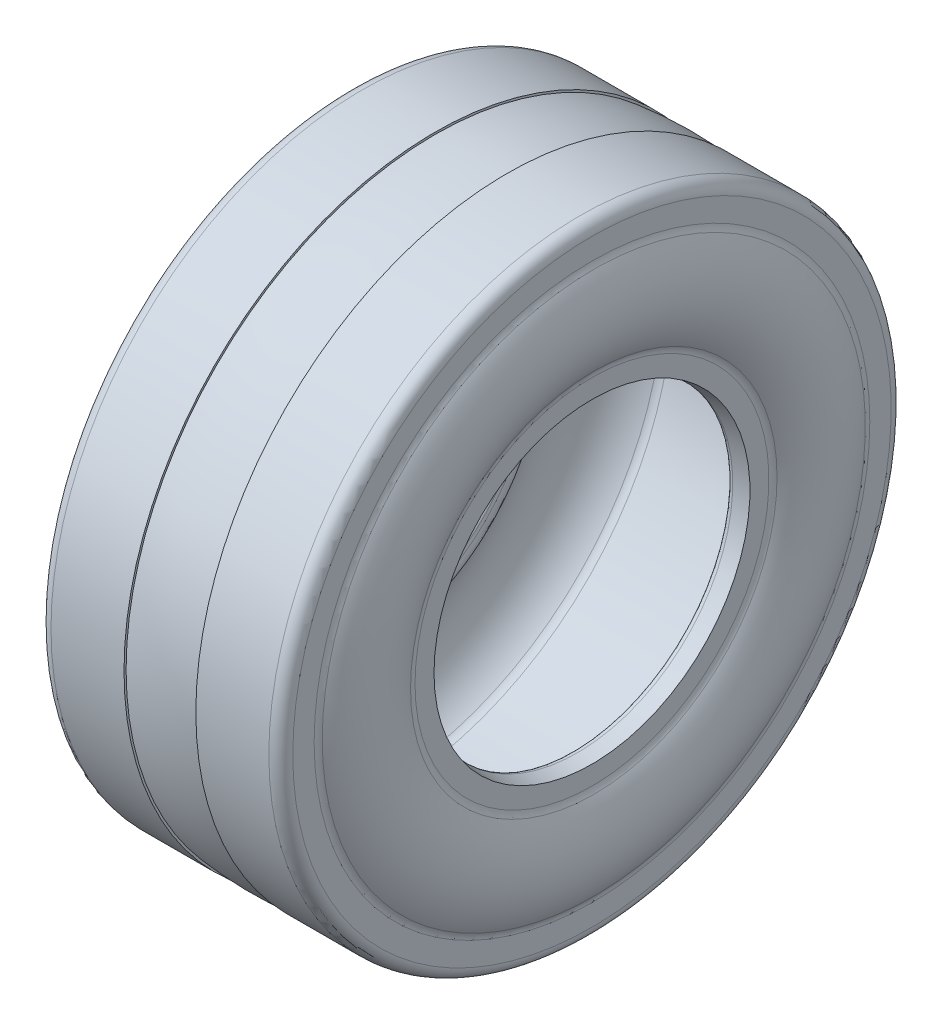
ISO-10303-21;
HEADER;
FILE_DESCRIPTION(('STEP AP214'),'2;1');
FILE_NAME('part.step','',(''),(''),'','','');
FILE_SCHEMA(('AUTOMOTIVE_DESIGN { 1 0 10303 214 1 1 1 1 }'));
ENDSEC;
DATA;
#1=APPLICATION_CONTEXT('core data for automotive mechanical design processes');
#2=APPLICATION_PROTOCOL_DEFINITION('international standard','automotive_design',2000,#1);
#3=PRODUCT_CONTEXT('',#1,'mechanical');
#4=PRODUCT('Part','Part','',(#3));
#5=PRODUCT_RELATED_PRODUCT_CATEGORY('part','',(#4));
#6=PRODUCT_DEFINITION_FORMATION('','',#4);
#7=PRODUCT_DEFINITION_CONTEXT('part definition',#1,'design');
#8=PRODUCT_DEFINITION('design','',#6,#7);
#9=PRODUCT_DEFINITION_SHAPE('','',#8);
#10=(LENGTH_UNIT() NAMED_UNIT(*) SI_UNIT(.MILLI.,.METRE.));
#11=(NAMED_UNIT(*) PLANE_ANGLE_UNIT() SI_UNIT($,.RADIAN.));
#12=(NAMED_UNIT(*) SI_UNIT($,.STERADIAN.) SOLID_ANGLE_UNIT());
#13=UNCERTAINTY_MEASURE_WITH_UNIT(LENGTH_MEASURE(1.E-05),#10,'distance_accuracy_value','');
#14=(GEOMETRIC_REPRESENTATION_CONTEXT(3) GLOBAL_UNCERTAINTY_ASSIGNED_CONTEXT((#13)) GLOBAL_UNIT_ASSIGNED_CONTEXT((#10,
#11,#12)) REPRESENTATION_CONTEXT('',''));
#15=CARTESIAN_POINT('',(0.,0.,0.));
#16=DIRECTION('',(0.,0.,1.));
#17=DIRECTION('',(1.,0.,0.));
#18=AXIS2_PLACEMENT_3D('',#15,#16,#17);
#19=CARTESIAN_POINT('',(2.35414438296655,-160.,0.));
#20=DIRECTION('',(-1.,0.,0.));
#21=DIRECTION('',(0.,0.,1.));
#22=AXIS2_PLACEMENT_3D('',#19,#20,#21);
#23=TOROIDAL_SURFACE('',#22,73.9286924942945,4.99999999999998);
#24=CARTESIAN_POINT('',(6.60414438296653,-160.,0.));
#25=DIRECTION('',(-1.,0.,0.));
#26=DIRECTION('',(0.,0.,1.));
#27=AXIS2_PLACEMENT_3D('',#24,#25,#26);
#28=CIRCLE('',#27,76.5626059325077);
#29=CARTESIAN_POINT('',(6.60414438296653,-160.,76.5626059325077));
#30=VERTEX_POINT('',#29);
#31=EDGE_CURVE('E130',#30,#30,#28,.T.);
#32=ORIENTED_EDGE('',*,*,#31,.T.);
#33=EDGE_LOOP('',(#32));
#34=FACE_BOUND('',#33,.T.);
#35=CARTESIAN_POINT('',(7.35414438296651,-160.,0.));
#36=DIRECTION('',(-1.,0.,0.));
#37=DIRECTION('',(0.,0.,1.));
#38=AXIS2_PLACEMENT_3D('',#35,#36,#37);
#39=CIRCLE('',#38,73.9286924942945);
#40=CARTESIAN_POINT('',(7.35414438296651,-160.,73.9286924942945));
#41=VERTEX_POINT('',#40);
#42=EDGE_CURVE('E10',#41,#41,#39,.T.);
#43=ORIENTED_EDGE('',*,*,#42,.F.);
#44=EDGE_LOOP('',(#43));
#45=FACE_BOUND('',#44,.T.);
#46=ADVANCED_FACE('F36',(#34,#45),#23,.F.);
#47=CARTESIAN_POINT('',(7.35414438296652,-86.0713075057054,0.));
#48=DIRECTION('',(1.,0.,0.));
#49=DIRECTION('',(0.,0.,-1.));
#50=AXIS2_PLACEMENT_3D('',#47,#48,#49);
#51=PLANE('',#50);
#52=CARTESIAN_POINT('',(7.35414438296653,-160.,0.));
#53=DIRECTION('',(-1.,0.,0.));
#54=DIRECTION('',(0.,0.,1.));
#55=AXIS2_PLACEMENT_3D('',#52,#53,#54);
#56=CIRCLE('',#55,66.);
#57=CARTESIAN_POINT('',(7.35414438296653,-160.,66.));
#58=VERTEX_POINT('',#57);
#59=EDGE_CURVE('E42',#58,#58,#56,.T.);
#60=ORIENTED_EDGE('',*,*,#59,.F.);
#61=EDGE_LOOP('',(#60));
#62=FACE_BOUND('',#61,.T.);
#63=ORIENTED_EDGE('',*,*,#42,.T.);
#64=EDGE_LOOP('',(#63));
#65=FACE_BOUND('',#64,.T.);
#66=ADVANCED_FACE('F154',(#62,#65),#51,.F.);
#67=CARTESIAN_POINT('',(7.35414438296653,-160.,0.));
#68=DIRECTION('',(-1.,0.,0.));
#69=DIRECTION('',(0.,0.,1.));
#70=AXIS2_PLACEMENT_3D('',#67,#68,#69);
#71=CONICAL_SURFACE('',#70,66.,0.157515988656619);
#72=CARTESIAN_POINT('',(13.5502001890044,-160.,0.));
#73=DIRECTION('',(-1.,0.,0.));
#74=DIRECTION('',(0.,0.,1.));
#75=AXIS2_PLACEMENT_3D('',#72,#73,#74);
#76=CIRCLE('',#75,65.015869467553);
#77=CARTESIAN_POINT('',(13.5502001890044,-160.,65.015869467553));
#78=VERTEX_POINT('',#77);
#79=EDGE_CURVE('E46',#78,#78,#76,.T.);
#80=ORIENTED_EDGE('',*,*,#79,.F.);
#81=EDGE_LOOP('',(#80));
#82=FACE_BOUND('',#81,.T.);
#83=ORIENTED_EDGE('',*,*,#59,.T.);
#84=EDGE_LOOP('',(#83));
#85=FACE_BOUND('',#84,.T.);
#86=ADVANCED_FACE('F158',(#82,#85),#71,.F.);
#87=CARTESIAN_POINT('',(13.8639310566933,-160.,0.));
#88=DIRECTION('',(-1.,0.,0.));
#89=DIRECTION('',(0.,0.,1.));
#90=AXIS2_PLACEMENT_3D('',#87,#88,#89);
#91=TOROIDAL_SURFACE('',#90,66.9911094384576,2.00000000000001);
#92=ORIENTED_EDGE('',*,*,#79,.T.);
#93=EDGE_LOOP('',(#92));
#94=FACE_BOUND('',#93,.T.);
#95=CARTESIAN_POINT('',(15.7721236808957,-160.,0.));
#96=DIRECTION('',(-1.,0.,0.));
#97=DIRECTION('',(0.,0.,1.));
#98=AXIS2_PLACEMENT_3D('',#95,#96,#97);
#99=CIRCLE('',#98,66.3921095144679);
#100=CARTESIAN_POINT('',(15.7721236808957,-160.,66.3921095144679));
#101=VERTEX_POINT('',#100);
#102=EDGE_CURVE('E50',#101,#101,#99,.T.);
#103=ORIENTED_EDGE('',*,*,#102,.F.);
#104=EDGE_LOOP('',(#103));
#105=FACE_BOUND('',#104,.T.);
#106=ADVANCED_FACE('F163',(#94,#105),#91,.T.);
#107=CARTESIAN_POINT('',(15.7721236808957,-160.,0.));
#108=DIRECTION('',(1.,0.,0.));
#109=DIRECTION('',(0.,0.,-1.));
#110=AXIS2_PLACEMENT_3D('',#107,#108,#109);
#111=CONICAL_SURFACE('',#110,66.3921095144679,1.26662781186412);
#112=CARTESIAN_POINT('',(16.1448141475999,-160.,0.));
#113=DIRECTION('',(-1.,0.,0.));
#114=DIRECTION('',(0.,0.,1.));
#115=AXIS2_PLACEMENT_3D('',#112,#113,#114);
#116=CIRCLE('',#115,67.5793637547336);
#117=CARTESIAN_POINT('',(16.1448141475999,-160.,67.5793637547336));
#118=VERTEX_POINT('',#117);
#119=EDGE_CURVE('E55',#118,#118,#116,.T.);
#120=ORIENTED_EDGE('',*,*,#119,.F.);
#121=EDGE_LOOP('',(#120));
#122=FACE_BOUND('',#121,.T.);
#123=ORIENTED_EDGE('',*,*,#102,.T.);
#124=EDGE_LOOP('',(#123));
#125=FACE_BOUND('',#124,.T.);
#126=ADVANCED_FACE('F169',(#122,#125),#111,.F.);
#127=CARTESIAN_POINT('',(11.3743325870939,-160.,0.));
#128=DIRECTION('',(-1.,0.,0.));
#129=DIRECTION('',(0.,0.,1.));
#130=AXIS2_PLACEMENT_3D('',#127,#128,#129);
#131=TOROIDAL_SURFACE('',#130,69.0768635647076,5.);
#132=ORIENTED_EDGE('',*,*,#119,.T.);
#133=EDGE_LOOP('',(#132));
#134=FACE_BOUND('',#133,.T.);
#135=CARTESIAN_POINT('',(14.8437508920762,-160.,0.));
#136=DIRECTION('',(-1.,0.,0.));
#137=DIRECTION('',(0.,0.,1.));
#138=AXIS2_PLACEMENT_3D('',#135,#136,#137);
#139=CIRCLE('',#138,72.6772991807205);
#140=CARTESIAN_POINT('',(14.8437508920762,-160.,72.6772991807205));
#141=VERTEX_POINT('',#140);
#142=EDGE_CURVE('E58',#141,#141,#139,.T.);
#143=ORIENTED_EDGE('',*,*,#142,.F.);
#144=EDGE_LOOP('',(#143));
#145=FACE_BOUND('',#144,.T.);
#146=ADVANCED_FACE('F173',(#134,#145),#131,.T.);
#147=CARTESIAN_POINT('',(36.3541443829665,-160.,0.));
#148=DIRECTION('',(-1.,0.,0.));
#149=DIRECTION('',(0.,0.,1.));
#150=AXIS2_PLACEMENT_3D('',#147,#148,#149);
#151=TOROIDAL_SURFACE('',#150,95.,31.);
#152=ORIENTED_EDGE('',*,*,#142,.T.);
#153=EDGE_LOOP('',(#152));
#154=FACE_BOUND('',#153,.T.);
#155=CARTESIAN_POINT('',(18.0764135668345,-160.,0.));
#156=DIRECTION('',(-1.,0.,0.));
#157=DIRECTION('',(0.,0.,1.));
#158=AXIS2_PLACEMENT_3D('',#155,#156,#157);
#159=CIRCLE('',#158,120.038461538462);
#160=CARTESIAN_POINT('',(18.0764135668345,-160.,120.038461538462));
#161=VERTEX_POINT('',#160);
#162=EDGE_CURVE('E61',#161,#161,#159,.T.);
#163=ORIENTED_EDGE('',*,*,#162,.F.);
#164=EDGE_LOOP('',(#163));
#165=FACE_BOUND('',#164,.T.);
#166=ADVANCED_FACE('F177',(#154,#165),#151,.F.);
#167=CARTESIAN_POINT('',(21.0244346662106,-160.,0.));
#168=DIRECTION('',(-1.,0.,0.));
#169=DIRECTION('',(0.,0.,1.));
#170=AXIS2_PLACEMENT_3D('',#167,#168,#169);
#171=TOROIDAL_SURFACE('',#170,116.,5.);
#172=ORIENTED_EDGE('',*,*,#162,.T.);
#173=EDGE_LOOP('',(#172));
#174=FACE_BOUND('',#173,.T.);
#175=CARTESIAN_POINT('',(21.0244346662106,-160.,0.));
#176=DIRECTION('',(-1.,0.,0.));
#177=DIRECTION('',(0.,0.,1.));
#178=AXIS2_PLACEMENT_3D('',#175,#176,#177);
#179=CIRCLE('',#178,121.);
#180=CARTESIAN_POINT('',(21.0244346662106,-160.,121.));
#181=VERTEX_POINT('',#180);
#182=EDGE_CURVE('E64',#181,#181,#179,.T.);
#183=ORIENTED_EDGE('',*,*,#182,.F.);
#184=EDGE_LOOP('',(#183));
#185=FACE_BOUND('',#184,.T.);
#186=ADVANCED_FACE('F181',(#174,#185),#171,.F.);
#187=CARTESIAN_POINT('',(0.,-160.,0.));
#188=DIRECTION('',(-1.,0.,0.));
#189=DIRECTION('',(0.,0.,1.));
#190=AXIS2_PLACEMENT_3D('',#187,#188,#189);
#191=CYLINDRICAL_SURFACE('',#190,121.);
#192=CARTESIAN_POINT('',(94.6838540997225,-160.,0.));
#193=DIRECTION('',(-1.,0.,0.));
#194=DIRECTION('',(0.,0.,1.));
#195=AXIS2_PLACEMENT_3D('',#192,#193,#194);
#196=CIRCLE('',#195,121.);
#197=CARTESIAN_POINT('',(94.6838540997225,-160.,121.));
#198=VERTEX_POINT('',#197);
#199=EDGE_CURVE('E67',#198,#198,#196,.T.);
#200=ORIENTED_EDGE('',*,*,#199,.F.);
#201=EDGE_LOOP('',(#200));
#202=FACE_BOUND('',#201,.T.);
#203=ORIENTED_EDGE('',*,*,#182,.T.);
#204=EDGE_LOOP('',(#203));
#205=FACE_BOUND('',#204,.T.);
#206=ADVANCED_FACE('F185',(#202,#205),#191,.F.);
#207=CARTESIAN_POINT('',(94.6838540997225,-160.,0.));
#208=DIRECTION('',(-1.,0.,0.));
#209=DIRECTION('',(0.,0.,1.));
#210=AXIS2_PLACEMENT_3D('',#207,#208,#209);
#211=TOROIDAL_SURFACE('',#210,116.,5.);
#212=CARTESIAN_POINT('',(97.6318751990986,-160.,0.));
#213=DIRECTION('',(-1.,0.,0.));
#214=DIRECTION('',(0.,0.,1.));
#215=AXIS2_PLACEMENT_3D('',#212,#213,#214);
#216=CIRCLE('',#215,120.038461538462);
#217=CARTESIAN_POINT('',(97.6318751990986,-160.,120.038461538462));
#218=VERTEX_POINT('',#217);
#219=EDGE_CURVE('E70',#218,#218,#216,.T.);
#220=ORIENTED_EDGE('',*,*,#219,.F.);
#221=EDGE_LOOP('',(#220));
#222=FACE_BOUND('',#221,.T.);
#223=ORIENTED_EDGE('',*,*,#199,.T.);
#224=EDGE_LOOP('',(#223));
#225=FACE_BOUND('',#224,.T.);
#226=ADVANCED_FACE('F189',(#222,#225),#211,.F.);
#227=CARTESIAN_POINT('',(79.3541443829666,-160.,0.));
#228=DIRECTION('',(-1.,0.,0.));
#229=DIRECTION('',(0.,0.,1.));
#230=AXIS2_PLACEMENT_3D('',#227,#228,#229);
#231=TOROIDAL_SURFACE('',#230,95.,31.);
#232=CARTESIAN_POINT('',(100.864537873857,-160.,0.));
#233=DIRECTION('',(-1.,0.,0.));
#234=DIRECTION('',(0.,0.,1.));
#235=AXIS2_PLACEMENT_3D('',#232,#233,#234);
#236=CIRCLE('',#235,72.6772991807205);
#237=CARTESIAN_POINT('',(100.864537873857,-160.,72.6772991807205));
#238=VERTEX_POINT('',#237);
#239=EDGE_CURVE('E73',#238,#238,#236,.T.);
#240=ORIENTED_EDGE('',*,*,#239,.F.);
#241=EDGE_LOOP('',(#240));
#242=FACE_BOUND('',#241,.T.);
#243=ORIENTED_EDGE('',*,*,#219,.T.);
#244=EDGE_LOOP('',(#243));
#245=FACE_BOUND('',#244,.T.);
#246=ADVANCED_FACE('F193',(#242,#245),#231,.F.);
#247=CARTESIAN_POINT('',(104.333956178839,-160.,0.));
#248=DIRECTION('',(-1.,0.,0.));
#249=DIRECTION('',(0.,0.,1.));
#250=AXIS2_PLACEMENT_3D('',#247,#248,#249);
#251=TOROIDAL_SURFACE('',#250,69.0768635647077,5.);
#252=CARTESIAN_POINT('',(99.5634746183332,-160.,0.));
#253=DIRECTION('',(-1.,0.,0.));
#254=DIRECTION('',(0.,0.,1.));
#255=AXIS2_PLACEMENT_3D('',#252,#253,#254);
#256=CIRCLE('',#255,67.5793637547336);
#257=CARTESIAN_POINT('',(99.5634746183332,-160.,67.5793637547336));
#258=VERTEX_POINT('',#257);
#259=EDGE_CURVE('E76',#258,#258,#256,.T.);
#260=ORIENTED_EDGE('',*,*,#259,.F.);
#261=EDGE_LOOP('',(#260));
#262=FACE_BOUND('',#261,.T.);
#263=ORIENTED_EDGE('',*,*,#239,.T.);
#264=EDGE_LOOP('',(#263));
#265=FACE_BOUND('',#264,.T.);
#266=ADVANCED_FACE('F197',(#262,#265),#251,.T.);
#267=CARTESIAN_POINT('',(99.9361650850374,-160.,0.));
#268=DIRECTION('',(-1.,0.,0.));
#269=DIRECTION('',(0.,0.,1.));
#270=AXIS2_PLACEMENT_3D('',#267,#268,#269);
#271=CONICAL_SURFACE('',#270,66.3921095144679,1.26662781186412);
#272=ORIENTED_EDGE('',*,*,#259,.T.);
#273=EDGE_LOOP('',(#272));
#274=FACE_BOUND('',#273,.T.);
#275=CARTESIAN_POINT('',(99.9361650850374,-160.,0.));
#276=DIRECTION('',(-1.,0.,0.));
#277=DIRECTION('',(0.,0.,1.));
#278=AXIS2_PLACEMENT_3D('',#275,#276,#277);
#279=CIRCLE('',#278,66.3921095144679);
#280=CARTESIAN_POINT('',(99.9361650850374,-160.,66.3921095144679));
#281=VERTEX_POINT('',#280);
#282=EDGE_CURVE('E79',#281,#281,#279,.T.);
#283=ORIENTED_EDGE('',*,*,#282,.F.);
#284=EDGE_LOOP('',(#283));
#285=FACE_BOUND('',#284,.T.);
#286=ADVANCED_FACE('F201',(#274,#285),#271,.F.);
#287=CARTESIAN_POINT('',(101.84435770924,-160.,0.));
#288=DIRECTION('',(-1.,0.,0.));
#289=DIRECTION('',(0.,0.,1.));
#290=AXIS2_PLACEMENT_3D('',#287,#288,#289);
#291=TOROIDAL_SURFACE('',#290,66.9911094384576,2.);
#292=CARTESIAN_POINT('',(102.158088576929,-160.,0.));
#293=DIRECTION('',(-1.,0.,0.));
#294=DIRECTION('',(0.,0.,1.));
#295=AXIS2_PLACEMENT_3D('',#292,#293,#294);
#296=CIRCLE('',#295,65.015869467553);
#297=CARTESIAN_POINT('',(102.158088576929,-160.,65.015869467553));
#298=VERTEX_POINT('',#297);
#299=EDGE_CURVE('E82',#298,#298,#296,.T.);
#300=ORIENTED_EDGE('',*,*,#299,.F.);
#301=EDGE_LOOP('',(#300));
#302=FACE_BOUND('',#301,.T.);
#303=ORIENTED_EDGE('',*,*,#282,.T.);
#304=EDGE_LOOP('',(#303));
#305=FACE_BOUND('',#304,.T.);
#306=ADVANCED_FACE('F205',(#302,#305),#291,.T.);
#307=CARTESIAN_POINT('',(108.354144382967,-160.,0.));
#308=DIRECTION('',(1.,0.,0.));
#309=DIRECTION('',(0.,0.,-1.));
#310=AXIS2_PLACEMENT_3D('',#307,#308,#309);
#311=CONICAL_SURFACE('',#310,66.,0.157515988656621);
#312=ORIENTED_EDGE('',*,*,#299,.T.);
#313=EDGE_LOOP('',(#312));
#314=FACE_BOUND('',#313,.T.);
#315=CARTESIAN_POINT('',(108.354144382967,-160.,0.));
#316=DIRECTION('',(-1.,0.,0.));
#317=DIRECTION('',(0.,0.,1.));
#318=AXIS2_PLACEMENT_3D('',#315,#316,#317);
#319=CIRCLE('',#318,66.);
#320=CARTESIAN_POINT('',(108.354144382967,-160.,66.));
#321=VERTEX_POINT('',#320);
#322=EDGE_CURVE('E85',#321,#321,#319,.T.);
#323=ORIENTED_EDGE('',*,*,#322,.F.);
#324=EDGE_LOOP('',(#323));
#325=FACE_BOUND('',#324,.T.);
#326=ADVANCED_FACE('F209',(#314,#325),#311,.F.);
#327=CARTESIAN_POINT('',(108.354144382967,-86.0713075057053,0.));
#328=DIRECTION('',(1.,0.,0.));
#329=DIRECTION('',(0.,0.,-1.));
#330=AXIS2_PLACEMENT_3D('',#327,#328,#329);
#331=PLANE('',#330);
#332=ORIENTED_EDGE('',*,*,#322,.T.);
#333=EDGE_LOOP('',(#332));
#334=FACE_BOUND('',#333,.T.);
#335=CARTESIAN_POINT('',(108.354144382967,-160.,0.));
#336=DIRECTION('',(-1.,0.,0.));
#337=DIRECTION('',(0.,0.,1.));
#338=AXIS2_PLACEMENT_3D('',#335,#336,#337);
#339=CIRCLE('',#338,73.9286924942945);
#340=CARTESIAN_POINT('',(108.354144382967,-160.,73.9286924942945));
#341=VERTEX_POINT('',#340);
#342=EDGE_CURVE('E88',#341,#341,#339,.T.);
#343=ORIENTED_EDGE('',*,*,#342,.F.);
#344=EDGE_LOOP('',(#343));
#345=FACE_BOUND('',#344,.T.);
#346=ADVANCED_FACE('F213',(#334,#345),#331,.T.);
#347=CARTESIAN_POINT('',(113.354144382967,-160.,0.));
#348=DIRECTION('',(-1.,0.,0.));
#349=DIRECTION('',(0.,0.,1.));
#350=AXIS2_PLACEMENT_3D('',#347,#348,#349);
#351=TOROIDAL_SURFACE('',#350,73.9286924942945,4.99999999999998);
#352=CARTESIAN_POINT('',(109.104144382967,-160.,0.));
#353=DIRECTION('',(-1.,0.,0.));
#354=DIRECTION('',(0.,0.,1.));
#355=AXIS2_PLACEMENT_3D('',#352,#353,#354);
#356=CIRCLE('',#355,76.5626059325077);
#357=CARTESIAN_POINT('',(109.104144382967,-160.,76.5626059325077));
#358=VERTEX_POINT('',#357);
#359=EDGE_CURVE('E91',#358,#358,#356,.T.);
#360=ORIENTED_EDGE('',*,*,#359,.F.);
#361=EDGE_LOOP('',(#360));
#362=FACE_BOUND('',#361,.T.);
#363=ORIENTED_EDGE('',*,*,#342,.T.);
#364=EDGE_LOOP('',(#363));
#365=FACE_BOUND('',#364,.T.);
#366=ADVANCED_FACE('F217',(#362,#365),#351,.F.);
#367=CARTESIAN_POINT('',(79.3541443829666,-160.,0.));
#368=DIRECTION('',(-1.,0.,0.));
#369=DIRECTION('',(0.,0.,1.));
#370=AXIS2_PLACEMENT_3D('',#367,#368,#369);
#371=TOROIDAL_SURFACE('',#370,95.,35.);
#372=ORIENTED_EDGE('',*,*,#359,.T.);
#373=EDGE_LOOP('',(#372));
#374=FACE_BOUND('',#373,.T.);
#375=CARTESIAN_POINT('',(109.104144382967,-160.,0.));
#376=DIRECTION('',(-1.,0.,0.));
#377=DIRECTION('',(0.,0.,1.));
#378=AXIS2_PLACEMENT_3D('',#375,#376,#377);
#379=CIRCLE('',#378,113.437394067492);
#380=CARTESIAN_POINT('',(109.104144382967,-160.,113.437394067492));
#381=VERTEX_POINT('',#380);
#382=EDGE_CURVE('E94',#381,#381,#379,.T.);
#383=ORIENTED_EDGE('',*,*,#382,.F.);
#384=EDGE_LOOP('',(#383));
#385=FACE_BOUND('',#384,.T.);
#386=ADVANCED_FACE('F221',(#374,#385),#371,.T.);
#387=CARTESIAN_POINT('',(113.354144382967,-160.,0.));
#388=DIRECTION('',(-1.,0.,0.));
#389=DIRECTION('',(0.,0.,1.));
#390=AXIS2_PLACEMENT_3D('',#387,#388,#389);
#391=TOROIDAL_SURFACE('',#390,116.071307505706,4.99999999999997);
#392=CARTESIAN_POINT('',(108.354144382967,-160.,0.));
#393=DIRECTION('',(-1.,0.,0.));
#394=DIRECTION('',(0.,0.,1.));
#395=AXIS2_PLACEMENT_3D('',#392,#393,#394);
#396=CIRCLE('',#395,116.071307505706);
#397=CARTESIAN_POINT('',(108.354144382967,-160.,116.071307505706));
#398=VERTEX_POINT('',#397);
#399=EDGE_CURVE('E97',#398,#398,#396,.T.);
#400=ORIENTED_EDGE('',*,*,#399,.F.);
#401=EDGE_LOOP('',(#400));
#402=FACE_BOUND('',#401,.T.);
#403=ORIENTED_EDGE('',*,*,#382,.T.);
#404=EDGE_LOOP('',(#403));
#405=FACE_BOUND('',#404,.T.);
#406=ADVANCED_FACE('F225',(#402,#405),#391,.F.);
#407=CARTESIAN_POINT('',(108.354144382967,-34.9999999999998,0.));
#408=DIRECTION('',(1.,0.,0.));
#409=DIRECTION('',(0.,0.,-1.));
#410=AXIS2_PLACEMENT_3D('',#407,#408,#409);
#411=PLANE('',#410);
#412=ORIENTED_EDGE('',*,*,#399,.T.);
#413=EDGE_LOOP('',(#412));
#414=FACE_BOUND('',#413,.T.);
#415=CARTESIAN_POINT('',(108.354144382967,-160.,0.));
#416=DIRECTION('',(-1.,0.,0.));
#417=DIRECTION('',(0.,0.,1.));
#418=AXIS2_PLACEMENT_3D('',#415,#416,#417);
#419=CIRCLE('',#418,125.);
#420=CARTESIAN_POINT('',(108.354144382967,-160.,125.));
#421=VERTEX_POINT('',#420);
#422=EDGE_CURVE('E100',#421,#421,#419,.T.);
#423=ORIENTED_EDGE('',*,*,#422,.F.);
#424=EDGE_LOOP('',(#423));
#425=FACE_BOUND('',#424,.T.);
#426=ADVANCED_FACE('F229',(#414,#425),#411,.T.);
#427=CARTESIAN_POINT('',(103.354144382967,-160.,0.));
#428=DIRECTION('',(-1.,0.,0.));
#429=DIRECTION('',(0.,0.,1.));
#430=AXIS2_PLACEMENT_3D('',#427,#428,#429);
#431=TOROIDAL_SURFACE('',#430,125.,5.);
#432=ORIENTED_EDGE('',*,*,#422,.T.);
#433=EDGE_LOOP('',(#432));
#434=FACE_BOUND('',#433,.T.);
#435=CARTESIAN_POINT('',(103.354144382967,-160.,0.));
#436=DIRECTION('',(-1.,0.,0.));
#437=DIRECTION('',(0.,0.,1.));
#438=AXIS2_PLACEMENT_3D('',#435,#436,#437);
#439=CIRCLE('',#438,130.);
#440=CARTESIAN_POINT('',(103.354144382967,-160.,130.));
#441=VERTEX_POINT('',#440);
#442=EDGE_CURVE('E103',#441,#441,#439,.T.);
#443=ORIENTED_EDGE('',*,*,#442,.F.);
#444=EDGE_LOOP('',(#443));
#445=FACE_BOUND('',#444,.T.);
#446=ADVANCED_FACE('F233',(#434,#445),#431,.T.);
#447=CARTESIAN_POINT('',(0.,-160.,0.));
#448=DIRECTION('',(-1.,0.,0.));
#449=DIRECTION('',(0.,0.,1.));
#450=AXIS2_PLACEMENT_3D('',#447,#448,#449);
#451=CYLINDRICAL_SURFACE('',#450,130.);
#452=ORIENTED_EDGE('',*,*,#442,.T.);
#453=EDGE_LOOP('',(#452));
#454=FACE_BOUND('',#453,.T.);
#455=CARTESIAN_POINT('',(72.8541443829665,-160.,0.));
#456=DIRECTION('',(-1.,0.,0.));
#457=DIRECTION('',(0.,0.,1.));
#458=AXIS2_PLACEMENT_3D('',#455,#456,#457);
#459=CIRCLE('',#458,130.);
#460=CARTESIAN_POINT('',(72.8541443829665,-160.,130.));
#461=VERTEX_POINT('',#460);
#462=EDGE_CURVE('E106',#461,#461,#459,.T.);
#463=ORIENTED_EDGE('',*,*,#462,.F.);
#464=EDGE_LOOP('',(#463));
#465=FACE_BOUND('',#464,.T.);
#466=ADVANCED_FACE('F237',(#454,#465),#451,.T.);
#467=CARTESIAN_POINT('',(72.8541443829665,-29.9999999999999,0.));
#468=DIRECTION('',(1.,0.,0.));
#469=DIRECTION('',(0.,0.,-1.));
#470=AXIS2_PLACEMENT_3D('',#467,#468,#469);
#471=PLANE('',#470);
#472=CARTESIAN_POINT('',(72.8541443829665,-160.,0.));
#473=DIRECTION('',(-1.,0.,0.));
#474=DIRECTION('',(0.,0.,1.));
#475=AXIS2_PLACEMENT_3D('',#472,#473,#474);
#476=CIRCLE('',#475,129.13171570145);
#477=CARTESIAN_POINT('',(72.8541443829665,-30.8682842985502,0.));
#478=VERTEX_POINT('',#477);
#479=EDGE_CURVE('E109',#478,#478,#476,.T.);
#480=ORIENTED_EDGE('',*,*,#479,.F.);
#481=EDGE_LOOP('',(#480));
#482=FACE_BOUND('',#481,.T.);
#483=ORIENTED_EDGE('',*,*,#462,.T.);
#484=EDGE_LOOP('',(#483));
#485=FACE_BOUND('',#484,.T.);
#486=ADVANCED_FACE('F241',(#482,#485),#471,.F.);
#487=CARTESIAN_POINT('',(57.8541443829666,-160.,0.));
#488=DIRECTION('',(-1.,0.,0.));
#489=DIRECTION('',(0.,1.,0.));
#490=AXIS2_PLACEMENT_3D('',#487,#488,#489);
#491=SPHERICAL_SURFACE('',#490,130.);
#492=CARTESIAN_POINT('',(42.8541443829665,-160.,0.));
#493=DIRECTION('',(-1.,0.,0.));
#494=DIRECTION('',(0.,0.,1.));
#495=AXIS2_PLACEMENT_3D('',#492,#493,#494);
#496=CIRCLE('',#495,129.13171570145);
#497=CARTESIAN_POINT('',(42.8541443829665,-30.8682842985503,0.));
#498=VERTEX_POINT('',#497);
#499=EDGE_CURVE('E112',#498,#498,#496,.T.);
#500=CARTESIAN_POINT('',(42.8541443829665,-30.8682842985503,0.));
#501=CARTESIAN_POINT('',(43.1652501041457,-30.8321460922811,0.));
#502=CARTESIAN_POINT('',(43.4764864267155,-30.7971322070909,0.));
#503=CARTESIAN_POINT('',(44.0992040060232,-30.7293548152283,0.));
#504=CARTESIAN_POINT('',(44.4106852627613,-30.6965913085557,0.));
#505=CARTESIAN_POINT('',(45.0338764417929,-30.6333164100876,0.));
#506=CARTESIAN_POINT('',(45.3455863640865,-30.602805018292,0.));
#507=CARTESIAN_POINT('',(45.969218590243,-30.5440359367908,0.));
#508=CARTESIAN_POINT('',(46.2811408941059,-30.5157782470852,0.));
#509=CARTESIAN_POINT('',(46.9051815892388,-30.4615180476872,0.));
#510=CARTESIAN_POINT('',(47.2172999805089,-30.4355155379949,0.));
#511=CARTESIAN_POINT('',(47.8417165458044,-30.3857670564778,0.));
#512=CARTESIAN_POINT('',(48.1540147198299,-30.362021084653,0.));
#513=CARTESIAN_POINT('',(48.7787745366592,-30.3167869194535,0.));
#514=CARTESIAN_POINT('',(49.091236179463,-30.2952987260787,0.));
#515=CARTESIAN_POINT('',(49.7163066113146,-30.2545812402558,0.));
#516=CARTESIAN_POINT('',(50.0289154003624,-30.2353519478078,0.));
#517=CARTESIAN_POINT('',(50.6542637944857,-30.1991532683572,0.));
#518=CARTESIAN_POINT('',(50.9670033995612,-30.1821838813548,0.));
#519=CARTESIAN_POINT('',(51.5925970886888,-30.1505058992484,0.));
#520=CARTESIAN_POINT('',(51.9054511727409,-30.1357973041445,0.));
#521=CARTESIAN_POINT('',(52.5312574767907,-30.108641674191,0.));
#522=CARTESIAN_POINT('',(52.8442096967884,-30.0961946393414,0.));
#523=CARTESIAN_POINT('',(53.4701959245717,-30.0735627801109,0.));
#524=CARTESIAN_POINT('',(53.7832299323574,-30.06337795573,0.));
#525=CARTESIAN_POINT('',(54.4093633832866,-30.045271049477,0.));
#526=CARTESIAN_POINT('',(54.7224628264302,-30.0373489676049,0.));
#527=CARTESIAN_POINT('',(55.3487107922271,-30.0237679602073,0.));
#528=CARTESIAN_POINT('',(55.6618593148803,-30.0181090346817,0.));
#529=CARTESIAN_POINT('',(56.2881890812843,-30.0090546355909,0.));
#530=CARTESIAN_POINT('',(56.6013703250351,-30.0056591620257,0.));
#531=CARTESIAN_POINT('',(57.2277491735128,-30.0011318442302,0.));
#532=CARTESIAN_POINT('',(57.5409467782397,-29.9999999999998,0.));
#533=CARTESIAN_POINT('',(58.1673419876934,-29.9999999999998,0.));
#534=CARTESIAN_POINT('',(58.4805395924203,-30.0011318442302,0.));
#535=CARTESIAN_POINT('',(59.106918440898,-30.0056591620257,0.));
#536=CARTESIAN_POINT('',(59.4200996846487,-30.0090546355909,0.));
#537=CARTESIAN_POINT('',(60.0464294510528,-30.0181090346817,0.));
#538=CARTESIAN_POINT('',(60.359577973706,-30.0237679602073,0.));
#539=CARTESIAN_POINT('',(60.9858259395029,-30.0373489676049,0.));
#540=CARTESIAN_POINT('',(61.2989253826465,-30.045271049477,0.));
#541=CARTESIAN_POINT('',(61.9250588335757,-30.06337795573,0.));
#542=CARTESIAN_POINT('',(62.2380928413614,-30.0735627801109,0.));
#543=CARTESIAN_POINT('',(62.8640790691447,-30.0961946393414,0.));
#544=CARTESIAN_POINT('',(63.1770312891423,-30.108641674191,0.));
#545=CARTESIAN_POINT('',(63.8028375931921,-30.1357973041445,0.));
#546=CARTESIAN_POINT('',(64.1156916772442,-30.1505058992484,0.));
#547=CARTESIAN_POINT('',(64.7412853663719,-30.1821838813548,0.));
#548=CARTESIAN_POINT('',(65.0540249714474,-30.1991532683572,0.));
#549=CARTESIAN_POINT('',(65.6793733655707,-30.2353519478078,0.));
#550=CARTESIAN_POINT('',(65.9919821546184,-30.2545812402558,0.));
#551=CARTESIAN_POINT('',(66.61705258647,-30.2952987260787,0.));
#552=CARTESIAN_POINT('',(66.9295142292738,-30.3167869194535,0.));
#553=CARTESIAN_POINT('',(67.5542740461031,-30.362021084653,0.));
#554=CARTESIAN_POINT('',(67.8665722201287,-30.3857670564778,0.));
#555=CARTESIAN_POINT('',(68.4909887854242,-30.4355155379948,0.));
#556=CARTESIAN_POINT('',(68.8031071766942,-30.4615180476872,0.));
#557=CARTESIAN_POINT('',(69.4271478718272,-30.5157782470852,0.));
#558=CARTESIAN_POINT('',(69.73907017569,-30.5440359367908,0.));
#559=CARTESIAN_POINT('',(70.3627024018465,-30.602805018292,0.));
#560=CARTESIAN_POINT('',(70.6744123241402,-30.6333164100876,0.));
#561=CARTESIAN_POINT('',(71.2976035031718,-30.6965913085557,0.));
#562=CARTESIAN_POINT('',(71.6090847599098,-30.7293548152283,0.));
#563=CARTESIAN_POINT('',(72.2318023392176,-30.7971322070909,0.));
#564=CARTESIAN_POINT('',(72.5430386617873,-30.832146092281,0.));
#565=CARTESIAN_POINT('',(72.8541443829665,-30.8682842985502,0.));
#566=B_SPLINE_CURVE_WITH_KNOTS('',3,(#500,#501,#502,#503,#504,#505,#506,#507,#508,#509,#510,
#511,#512,#513,#514,#515,#516,#517,#518,#519,#520,#521,#522,#523,#524,#525,#526,#527,#528,#529,
#530,#531,#532,#533,#534,#535,#536,#537,#538,#539,#540,#541,#542,#543,#544,#545,#546,#547,#548,
#549,#550,#551,#552,#553,#554,#555,#556,#557,#558,#559,#560,#561,#562,#563,#564,#565),
.UNSPECIFIED.,.F.,.F.,(4,2,2,2,2,2,2,2,2,2,2,2,2,2,2,2,2,2,2,2,2,2,2,2,2,2,2,2,2,2,2,2,4),(0.,
0.939590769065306,1.87918153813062,2.81877230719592,3.75836307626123,4.69795384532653,
5.63754461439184,6.57713538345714,7.51672615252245,8.45631692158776,9.39590769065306,
10.3354984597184,11.2750892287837,12.214679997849,13.1542707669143,14.0938615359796,
15.0334523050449,15.9730430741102,16.9126338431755,17.8522246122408,18.7918153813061,
19.7314061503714,20.6709969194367,21.610587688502,22.5501784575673,23.4897692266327,
24.429359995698,25.3689507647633,26.3085415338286,27.2481323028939,28.1877230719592,
29.1273138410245,30.0669046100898),.UNSPECIFIED.);
#567=EDGE_CURVE('BSEAM245',#498,#478,#566,.T.);
#568=ORIENTED_EDGE('',*,*,#499,.F.);
#569=ORIENTED_EDGE('',*,*,#479,.T.);
#570=ORIENTED_EDGE('',*,*,#567,.T.);
#571=ORIENTED_EDGE('',*,*,#567,.F.);
#572=EDGE_LOOP('',(#568,#570,#569,#571));
#573=FACE_BOUND('',#572,.T.);
#574=ADVANCED_FACE('F245',(#573),#491,.T.);
#575=CARTESIAN_POINT('',(42.8541443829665,-29.9999999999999,0.));
#576=DIRECTION('',(1.,0.,0.));
#577=DIRECTION('',(0.,0.,-1.));
#578=AXIS2_PLACEMENT_3D('',#575,#576,#577);
#579=PLANE('',#578);
#580=ORIENTED_EDGE('',*,*,#499,.T.);
#581=EDGE_LOOP('',(#580));
#582=FACE_BOUND('',#581,.T.);
#583=CARTESIAN_POINT('',(42.8541443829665,-160.,0.));
#584=DIRECTION('',(-1.,0.,0.));
#585=DIRECTION('',(0.,0.,1.));
#586=AXIS2_PLACEMENT_3D('',#583,#584,#585);
#587=CIRCLE('',#586,130.);
#588=CARTESIAN_POINT('',(42.8541443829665,-160.,130.));
#589=VERTEX_POINT('',#588);
#590=EDGE_CURVE('E115',#589,#589,#587,.T.);
#591=ORIENTED_EDGE('',*,*,#590,.F.);
#592=EDGE_LOOP('',(#591));
#593=FACE_BOUND('',#592,.T.);
#594=ADVANCED_FACE('F249',(#582,#593),#579,.T.);
#595=CARTESIAN_POINT('',(0.,-160.,0.));
#596=DIRECTION('',(-1.,0.,0.));
#597=DIRECTION('',(0.,0.,1.));
#598=AXIS2_PLACEMENT_3D('',#595,#596,#597);
#599=CYLINDRICAL_SURFACE('',#598,130.);
#600=ORIENTED_EDGE('',*,*,#590,.T.);
#601=EDGE_LOOP('',(#600));
#602=FACE_BOUND('',#601,.T.);
#603=CARTESIAN_POINT('',(12.3541443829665,-160.,0.));
#604=DIRECTION('',(-1.,0.,0.));
#605=DIRECTION('',(0.,0.,1.));
#606=AXIS2_PLACEMENT_3D('',#603,#604,#605);
#607=CIRCLE('',#606,130.);
#608=CARTESIAN_POINT('',(12.3541443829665,-160.,130.));
#609=VERTEX_POINT('',#608);
#610=EDGE_CURVE('E118',#609,#609,#607,.T.);
#611=ORIENTED_EDGE('',*,*,#610,.F.);
#612=EDGE_LOOP('',(#611));
#613=FACE_BOUND('',#612,.T.);
#614=ADVANCED_FACE('F253',(#602,#613),#599,.T.);
#615=CARTESIAN_POINT('',(12.3541443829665,-160.,0.));
#616=DIRECTION('',(-1.,0.,0.));
#617=DIRECTION('',(0.,0.,1.));
#618=AXIS2_PLACEMENT_3D('',#615,#616,#617);
#619=TOROIDAL_SURFACE('',#618,125.,5.);
#620=CARTESIAN_POINT('',(7.35414438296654,-160.,0.));
#621=DIRECTION('',(-1.,0.,0.));
#622=DIRECTION('',(0.,0.,1.));
#623=AXIS2_PLACEMENT_3D('',#620,#621,#622);
#624=CIRCLE('',#623,125.);
#625=CARTESIAN_POINT('',(7.35414438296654,-160.,125.));
#626=VERTEX_POINT('',#625);
#627=EDGE_CURVE('E121',#626,#626,#624,.T.);
#628=ORIENTED_EDGE('',*,*,#627,.F.);
#629=EDGE_LOOP('',(#628));
#630=FACE_BOUND('',#629,.T.);
#631=ORIENTED_EDGE('',*,*,#610,.T.);
#632=EDGE_LOOP('',(#631));
#633=FACE_BOUND('',#632,.T.);
#634=ADVANCED_FACE('F150',(#630,#633),#619,.T.);
#635=CARTESIAN_POINT('',(7.35414438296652,-34.9999999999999,0.));
#636=DIRECTION('',(1.,0.,0.));
#637=DIRECTION('',(0.,0.,-1.));
#638=AXIS2_PLACEMENT_3D('',#635,#636,#637);
#639=PLANE('',#638);
#640=CARTESIAN_POINT('',(7.35414438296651,-160.,0.));
#641=DIRECTION('',(-1.,0.,0.));
#642=DIRECTION('',(0.,0.,1.));
#643=AXIS2_PLACEMENT_3D('',#640,#641,#642);
#644=CIRCLE('',#643,116.071307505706);
#645=CARTESIAN_POINT('',(7.35414438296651,-160.,116.071307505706));
#646=VERTEX_POINT('',#645);
#647=EDGE_CURVE('E124',#646,#646,#644,.T.);
#648=ORIENTED_EDGE('',*,*,#647,.F.);
#649=EDGE_LOOP('',(#648));
#650=FACE_BOUND('',#649,.T.);
#651=ORIENTED_EDGE('',*,*,#627,.T.);
#652=EDGE_LOOP('',(#651));
#653=FACE_BOUND('',#652,.T.);
#654=ADVANCED_FACE('F144',(#650,#653),#639,.F.);
#655=CARTESIAN_POINT('',(2.35414438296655,-160.,0.));
#656=DIRECTION('',(-1.,0.,0.));
#657=DIRECTION('',(0.,0.,1.));
#658=AXIS2_PLACEMENT_3D('',#655,#656,#657);
#659=TOROIDAL_SURFACE('',#658,116.071307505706,4.99999999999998);
#660=ORIENTED_EDGE('',*,*,#647,.T.);
#661=EDGE_LOOP('',(#660));
#662=FACE_BOUND('',#661,.T.);
#663=CARTESIAN_POINT('',(6.60414438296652,-160.,0.));
#664=DIRECTION('',(-1.,0.,0.));
#665=DIRECTION('',(0.,0.,1.));
#666=AXIS2_PLACEMENT_3D('',#663,#664,#665);
#667=CIRCLE('',#666,113.437394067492);
#668=CARTESIAN_POINT('',(6.60414438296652,-160.,113.437394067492));
#669=VERTEX_POINT('',#668);
#670=EDGE_CURVE('E127',#669,#669,#667,.T.);
#671=ORIENTED_EDGE('',*,*,#670,.F.);
#672=EDGE_LOOP('',(#671));
#673=FACE_BOUND('',#672,.T.);
#674=ADVANCED_FACE('F139',(#662,#673),#659,.F.);
#675=CARTESIAN_POINT('',(36.3541443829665,-160.,0.));
#676=DIRECTION('',(-1.,0.,0.));
#677=DIRECTION('',(0.,0.,1.));
#678=AXIS2_PLACEMENT_3D('',#675,#676,#677);
#679=TOROIDAL_SURFACE('',#678,95.,35.);
#680=ORIENTED_EDGE('',*,*,#31,.F.);
#681=EDGE_LOOP('',(#680));
#682=FACE_BOUND('',#681,.T.);
#683=ORIENTED_EDGE('',*,*,#670,.T.);
#684=EDGE_LOOP('',(#683));
#685=FACE_BOUND('',#684,.T.);
#686=ADVANCED_FACE('F136',(#682,#685),#679,.T.);
#687=CLOSED_SHELL('',(#46,#66,#86,#106,#126,#146,#166,#186,#206,#226,#246,#266,#286,#306,#326,
#346,#366,#386,#406,#426,#446,#466,#486,#574,#594,#614,#634,#654,#674,#686));
#688=MANIFOLD_SOLID_BREP('B2',#687);
#689=ADVANCED_BREP_SHAPE_REPRESENTATION('',(#18,#688),#14);
#690=SHAPE_DEFINITION_REPRESENTATION(#9,#689);
ENDSEC;
END-ISO-10303-21;
